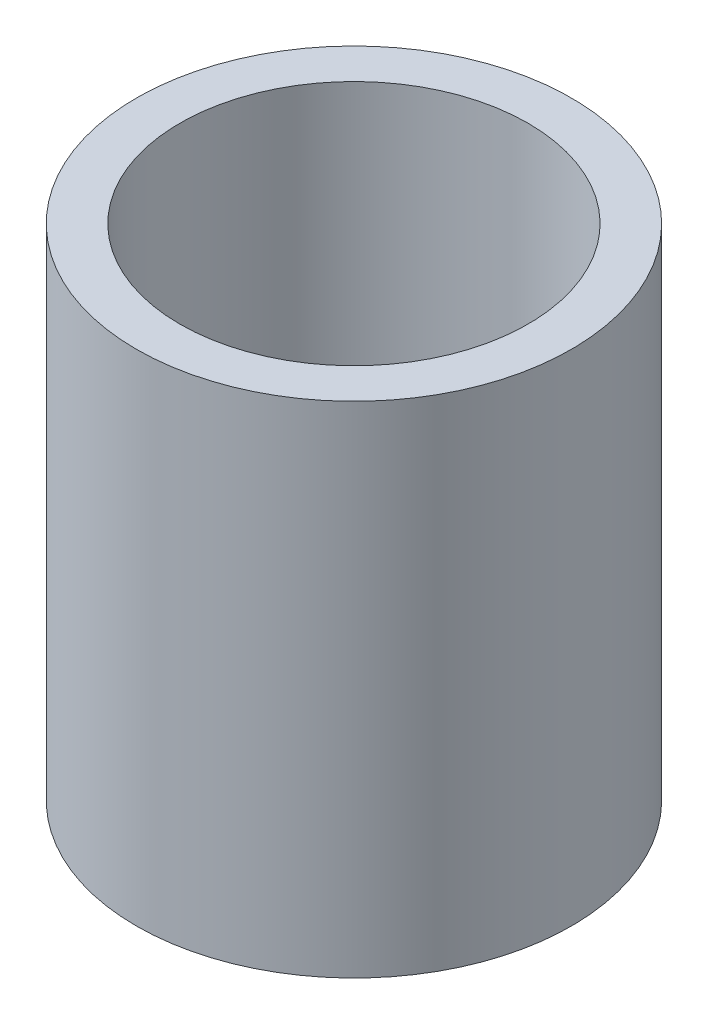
ISO-10303-21;
HEADER;
FILE_DESCRIPTION(('STEP AP214'),'2;1');
FILE_NAME('part.step','',(''),(''),'','','');
FILE_SCHEMA(('AUTOMOTIVE_DESIGN { 1 0 10303 214 1 1 1 1 }'));
ENDSEC;
DATA;
#1=APPLICATION_CONTEXT('core data for automotive mechanical design processes');
#2=APPLICATION_PROTOCOL_DEFINITION('international standard','automotive_design',2000,#1);
#3=PRODUCT_CONTEXT('',#1,'mechanical');
#4=PRODUCT('Part','Part','',(#3));
#5=PRODUCT_RELATED_PRODUCT_CATEGORY('part','',(#4));
#6=PRODUCT_DEFINITION_FORMATION('','',#4);
#7=PRODUCT_DEFINITION_CONTEXT('part definition',#1,'design');
#8=PRODUCT_DEFINITION('design','',#6,#7);
#9=PRODUCT_DEFINITION_SHAPE('','',#8);
#10=(LENGTH_UNIT() NAMED_UNIT(*) SI_UNIT(.MILLI.,.METRE.));
#11=(NAMED_UNIT(*) PLANE_ANGLE_UNIT() SI_UNIT($,.RADIAN.));
#12=(NAMED_UNIT(*) SI_UNIT($,.STERADIAN.) SOLID_ANGLE_UNIT());
#13=UNCERTAINTY_MEASURE_WITH_UNIT(LENGTH_MEASURE(1.E-05),#10,'distance_accuracy_value','');
#14=(GEOMETRIC_REPRESENTATION_CONTEXT(3) GLOBAL_UNCERTAINTY_ASSIGNED_CONTEXT((#13)) GLOBAL_UNIT_ASSIGNED_CONTEXT((#10,
#11,#12)) REPRESENTATION_CONTEXT('',''));
#15=CARTESIAN_POINT('',(0.,0.,0.));
#16=DIRECTION('',(0.,0.,1.));
#17=DIRECTION('',(1.,0.,0.));
#18=AXIS2_PLACEMENT_3D('',#15,#16,#17);
#19=CARTESIAN_POINT('',(0.,132.,0.));
#20=DIRECTION('',(0.,1.,0.));
#21=DIRECTION('',(0.,0.,1.));
#22=AXIS2_PLACEMENT_3D('',#19,#20,#21);
#23=PLANE('',#22);
#24=CARTESIAN_POINT('',(0.,132.,0.));
#25=DIRECTION('',(0.,1.,0.));
#26=DIRECTION('',(0.,0.,1.));
#27=AXIS2_PLACEMENT_3D('',#24,#25,#26);
#28=CIRCLE('',#27,57.5);
#29=CARTESIAN_POINT('',(0.,132.,57.5));
#30=VERTEX_POINT('',#29);
#31=EDGE_CURVE('E10',#30,#30,#28,.T.);
#32=ORIENTED_EDGE('',*,*,#31,.T.);
#33=EDGE_LOOP('',(#32));
#34=FACE_BOUND('',#33,.T.);
#35=CARTESIAN_POINT('',(0.,132.,0.));
#36=DIRECTION('',(0.,1.,0.));
#37=DIRECTION('',(0.,0.,1.));
#38=AXIS2_PLACEMENT_3D('',#35,#36,#37);
#39=CIRCLE('',#38,46.);
#40=CARTESIAN_POINT('',(0.,132.,46.));
#41=VERTEX_POINT('',#40);
#42=EDGE_CURVE('E41',#41,#41,#39,.T.);
#43=ORIENTED_EDGE('',*,*,#42,.F.);
#44=EDGE_LOOP('',(#43));
#45=FACE_BOUND('',#44,.T.);
#46=ADVANCED_FACE('F30',(#34,#45),#23,.T.);
#47=CARTESIAN_POINT('',(0.,0.,0.));
#48=DIRECTION('',(0.,1.,0.));
#49=DIRECTION('',(0.,0.,1.));
#50=AXIS2_PLACEMENT_3D('',#47,#48,#49);
#51=PLANE('',#50);
#52=CARTESIAN_POINT('',(0.,0.,0.));
#53=DIRECTION('',(0.,1.,0.));
#54=DIRECTION('',(0.,0.,1.));
#55=AXIS2_PLACEMENT_3D('',#52,#53,#54);
#56=CIRCLE('',#55,57.5);
#57=CARTESIAN_POINT('',(0.,0.,57.5));
#58=VERTEX_POINT('',#57);
#59=EDGE_CURVE('E37',#58,#58,#56,.T.);
#60=ORIENTED_EDGE('',*,*,#59,.F.);
#61=EDGE_LOOP('',(#60));
#62=FACE_BOUND('',#61,.T.);
#63=CARTESIAN_POINT('',(0.,0.,0.));
#64=DIRECTION('',(0.,1.,0.));
#65=DIRECTION('',(0.,0.,1.));
#66=AXIS2_PLACEMENT_3D('',#63,#64,#65);
#67=CIRCLE('',#66,46.);
#68=CARTESIAN_POINT('',(0.,0.,46.));
#69=VERTEX_POINT('',#68);
#70=EDGE_CURVE('E45',#69,#69,#67,.T.);
#71=ORIENTED_EDGE('',*,*,#70,.T.);
#72=EDGE_LOOP('',(#71));
#73=FACE_BOUND('',#72,.T.);
#74=ADVANCED_FACE('F51',(#62,#73),#51,.F.);
#75=CARTESIAN_POINT('',(0.,132.,0.));
#76=DIRECTION('',(0.,-1.,0.));
#77=DIRECTION('',(0.,0.,-1.));
#78=AXIS2_PLACEMENT_3D('',#75,#76,#77);
#79=CYLINDRICAL_SURFACE('',#78,57.5);
#80=ORIENTED_EDGE('',*,*,#31,.F.);
#81=EDGE_LOOP('',(#80));
#82=FACE_BOUND('',#81,.T.);
#83=ORIENTED_EDGE('',*,*,#59,.T.);
#84=EDGE_LOOP('',(#83));
#85=FACE_BOUND('',#84,.T.);
#86=ADVANCED_FACE('F32',(#82,#85),#79,.T.);
#87=CARTESIAN_POINT('',(0.,132.,0.));
#88=DIRECTION('',(0.,-1.,0.));
#89=DIRECTION('',(0.,0.,-1.));
#90=AXIS2_PLACEMENT_3D('',#87,#88,#89);
#91=CYLINDRICAL_SURFACE('',#90,46.);
#92=ORIENTED_EDGE('',*,*,#42,.T.);
#93=EDGE_LOOP('',(#92));
#94=FACE_BOUND('',#93,.T.);
#95=ORIENTED_EDGE('',*,*,#70,.F.);
#96=EDGE_LOOP('',(#95));
#97=FACE_BOUND('',#96,.T.);
#98=ADVANCED_FACE('F53',(#94,#97),#91,.F.);
#99=CLOSED_SHELL('',(#46,#74,#86,#98));
#100=MANIFOLD_SOLID_BREP('B2',#99);
#101=ADVANCED_BREP_SHAPE_REPRESENTATION('',(#18,#100),#14);
#102=SHAPE_DEFINITION_REPRESENTATION(#9,#101);
ENDSEC;
END-ISO-10303-21;
